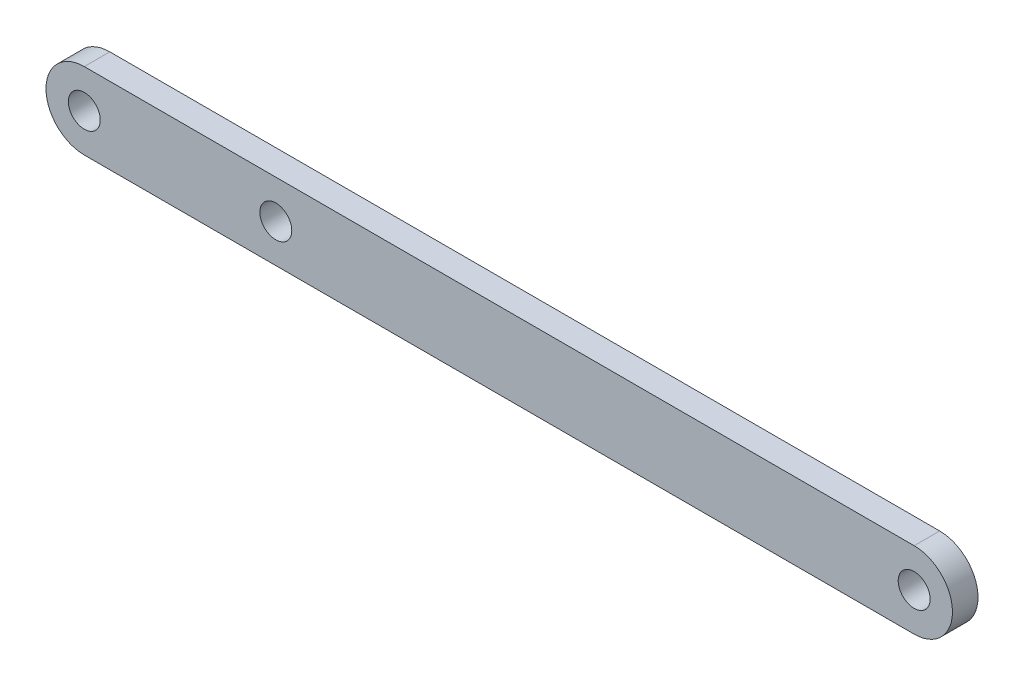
ISO-10303-21;
HEADER;
FILE_DESCRIPTION(('STEP AP214'),'2;1');
FILE_NAME('part.step','',(''),(''),'','','');
FILE_SCHEMA(('AUTOMOTIVE_DESIGN { 1 0 10303 214 1 1 1 1 }'));
ENDSEC;
DATA;
#1=APPLICATION_CONTEXT('core data for automotive mechanical design processes');
#2=APPLICATION_PROTOCOL_DEFINITION('international standard','automotive_design',2000,#1);
#3=PRODUCT_CONTEXT('',#1,'mechanical');
#4=PRODUCT('Part','Part','',(#3));
#5=PRODUCT_RELATED_PRODUCT_CATEGORY('part','',(#4));
#6=PRODUCT_DEFINITION_FORMATION('','',#4);
#7=PRODUCT_DEFINITION_CONTEXT('part definition',#1,'design');
#8=PRODUCT_DEFINITION('design','',#6,#7);
#9=PRODUCT_DEFINITION_SHAPE('','',#8);
#10=(LENGTH_UNIT() NAMED_UNIT(*) SI_UNIT(.MILLI.,.METRE.));
#11=(NAMED_UNIT(*) PLANE_ANGLE_UNIT() SI_UNIT($,.RADIAN.));
#12=(NAMED_UNIT(*) SI_UNIT($,.STERADIAN.) SOLID_ANGLE_UNIT());
#13=UNCERTAINTY_MEASURE_WITH_UNIT(LENGTH_MEASURE(1.E-05),#10,'distance_accuracy_value','');
#14=(GEOMETRIC_REPRESENTATION_CONTEXT(3) GLOBAL_UNCERTAINTY_ASSIGNED_CONTEXT((#13)) GLOBAL_UNIT_ASSIGNED_CONTEXT((#10,
#11,#12)) REPRESENTATION_CONTEXT('',''));
#15=CARTESIAN_POINT('',(0.,0.,0.));
#16=DIRECTION('',(0.,0.,1.));
#17=DIRECTION('',(1.,0.,0.));
#18=AXIS2_PLACEMENT_3D('',#15,#16,#17);
#19=CARTESIAN_POINT('',(0.,5.99999999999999,4.));
#20=DIRECTION('',(0.,1.,0.));
#21=DIRECTION('',(-1.,0.,0.));
#22=AXIS2_PLACEMENT_3D('',#19,#20,#21);
#23=PLANE('',#22);
#24=DIRECTION('',(1.,0.,0.));
#25=VECTOR('',#24,1.);
#26=CARTESIAN_POINT('',(0.,5.99999999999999,0.));
#27=LINE('',#26,#25);
#28=CARTESIAN_POINT('',(-80.,6.,0.));
#29=VERTEX_POINT('',#28);
#30=CARTESIAN_POINT('',(50.,6.00000000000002,0.));
#31=VERTEX_POINT('',#30);
#32=EDGE_CURVE('E108',#29,#31,#27,.T.);
#33=ORIENTED_EDGE('',*,*,#32,.F.);
#34=DIRECTION('',(0.,0.,-1.));
#35=VECTOR('',#34,1.);
#36=CARTESIAN_POINT('',(-80.,6.,4.));
#37=LINE('',#36,#35);
#38=CARTESIAN_POINT('',(-80.,6.,4.));
#39=VERTEX_POINT('',#38);
#40=EDGE_CURVE('E11',#39,#29,#37,.T.);
#41=ORIENTED_EDGE('',*,*,#40,.F.);
#42=DIRECTION('',(1.,0.,0.));
#43=VECTOR('',#42,1.);
#44=CARTESIAN_POINT('',(0.,5.99999999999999,4.));
#45=LINE('',#44,#43);
#46=CARTESIAN_POINT('',(50.,6.00000000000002,4.));
#47=VERTEX_POINT('',#46);
#48=EDGE_CURVE('E94',#39,#47,#45,.T.);
#49=ORIENTED_EDGE('',*,*,#48,.T.);
#50=DIRECTION('',(0.,0.,-1.));
#51=VECTOR('',#50,1.);
#52=CARTESIAN_POINT('',(50.,6.00000000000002,4.));
#53=LINE('',#52,#51);
#54=EDGE_CURVE('E76',#47,#31,#53,.T.);
#55=ORIENTED_EDGE('',*,*,#54,.T.);
#56=EDGE_LOOP('',(#33,#41,#49,#55));
#57=FACE_BOUND('',#56,.T.);
#58=ADVANCED_FACE('F37',(#57),#23,.T.);
#59=CARTESIAN_POINT('',(-80.,0.,4.));
#60=DIRECTION('',(0.,0.,-1.));
#61=DIRECTION('',(-1.,0.,0.));
#62=AXIS2_PLACEMENT_3D('',#59,#60,#61);
#63=CYLINDRICAL_SURFACE('',#62,6.);
#64=CARTESIAN_POINT('',(-80.,0.,0.));
#65=DIRECTION('',(0.,0.,1.));
#66=DIRECTION('',(1.,0.,0.));
#67=AXIS2_PLACEMENT_3D('',#64,#65,#66);
#68=CIRCLE('',#67,6.);
#69=CARTESIAN_POINT('',(-80.,-6.,0.));
#70=VERTEX_POINT('',#69);
#71=EDGE_CURVE('E99',#29,#70,#68,.T.);
#72=ORIENTED_EDGE('',*,*,#71,.T.);
#73=DIRECTION('',(0.,0.,-1.));
#74=VECTOR('',#73,1.);
#75=CARTESIAN_POINT('',(-80.,-6.,4.));
#76=LINE('',#75,#74);
#77=CARTESIAN_POINT('',(-80.,-6.,4.));
#78=VERTEX_POINT('',#77);
#79=EDGE_CURVE('E46',#78,#70,#76,.T.);
#80=ORIENTED_EDGE('',*,*,#79,.F.);
#81=CARTESIAN_POINT('',(-80.,0.,4.));
#82=DIRECTION('',(0.,0.,1.));
#83=DIRECTION('',(1.,0.,0.));
#84=AXIS2_PLACEMENT_3D('',#81,#82,#83);
#85=CIRCLE('',#84,6.);
#86=EDGE_CURVE('E91',#39,#78,#85,.T.);
#87=ORIENTED_EDGE('',*,*,#86,.F.);
#88=ORIENTED_EDGE('',*,*,#40,.T.);
#89=EDGE_LOOP('',(#72,#80,#87,#88));
#90=FACE_BOUND('',#89,.T.);
#91=ADVANCED_FACE('F97',(#90),#63,.T.);
#92=CARTESIAN_POINT('',(0.,-5.99999999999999,4.));
#93=DIRECTION('',(0.,1.,0.));
#94=DIRECTION('',(-1.,0.,0.));
#95=AXIS2_PLACEMENT_3D('',#92,#93,#94);
#96=PLANE('',#95);
#97=DIRECTION('',(1.,0.,0.));
#98=VECTOR('',#97,1.);
#99=CARTESIAN_POINT('',(0.,-5.99999999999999,0.));
#100=LINE('',#99,#98);
#101=CARTESIAN_POINT('',(50.,-5.99999999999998,0.));
#102=VERTEX_POINT('',#101);
#103=EDGE_CURVE('E105',#70,#102,#100,.T.);
#104=ORIENTED_EDGE('',*,*,#103,.T.);
#105=DIRECTION('',(0.,0.,-1.));
#106=VECTOR('',#105,1.);
#107=CARTESIAN_POINT('',(50.,-5.99999999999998,4.));
#108=LINE('',#107,#106);
#109=CARTESIAN_POINT('',(50.,-5.99999999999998,4.));
#110=VERTEX_POINT('',#109);
#111=EDGE_CURVE('E90',#110,#102,#108,.T.);
#112=ORIENTED_EDGE('',*,*,#111,.F.);
#113=DIRECTION('',(1.,0.,0.));
#114=VECTOR('',#113,1.);
#115=CARTESIAN_POINT('',(0.,-5.99999999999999,4.));
#116=LINE('',#115,#114);
#117=EDGE_CURVE('E84',#78,#110,#116,.T.);
#118=ORIENTED_EDGE('',*,*,#117,.F.);
#119=ORIENTED_EDGE('',*,*,#79,.T.);
#120=EDGE_LOOP('',(#104,#112,#118,#119));
#121=FACE_BOUND('',#120,.T.);
#122=ADVANCED_FACE('F87',(#121),#96,.F.);
#123=CARTESIAN_POINT('',(-80.,0.,4.));
#124=DIRECTION('',(0.,0.,-1.));
#125=DIRECTION('',(-1.,0.,0.));
#126=AXIS2_PLACEMENT_3D('',#123,#124,#125);
#127=CYLINDRICAL_SURFACE('',#126,2.5);
#128=CARTESIAN_POINT('',(-80.,0.,4.));
#129=DIRECTION('',(0.,0.,1.));
#130=DIRECTION('',(1.,0.,0.));
#131=AXIS2_PLACEMENT_3D('',#128,#129,#130);
#132=CIRCLE('',#131,2.5);
#133=CARTESIAN_POINT('',(-77.5,0.,4.));
#134=VERTEX_POINT('',#133);
#135=EDGE_CURVE('E121',#134,#134,#132,.T.);
#136=ORIENTED_EDGE('',*,*,#135,.T.);
#137=EDGE_LOOP('',(#136));
#138=FACE_BOUND('',#137,.T.);
#139=CARTESIAN_POINT('',(-80.,0.,0.));
#140=DIRECTION('',(0.,0.,1.));
#141=DIRECTION('',(1.,0.,0.));
#142=AXIS2_PLACEMENT_3D('',#139,#140,#141);
#143=CIRCLE('',#142,2.5);
#144=CARTESIAN_POINT('',(-77.5,0.,0.));
#145=VERTEX_POINT('',#144);
#146=EDGE_CURVE('E110',#145,#145,#143,.T.);
#147=ORIENTED_EDGE('',*,*,#146,.F.);
#148=EDGE_LOOP('',(#147));
#149=FACE_BOUND('',#148,.T.);
#150=ADVANCED_FACE('F141',(#138,#149),#127,.F.);
#151=CARTESIAN_POINT('',(50.,0.,4.));
#152=DIRECTION('',(0.,0.,-1.));
#153=DIRECTION('',(-1.,0.,0.));
#154=AXIS2_PLACEMENT_3D('',#151,#152,#153);
#155=CYLINDRICAL_SURFACE('',#154,2.5);
#156=CARTESIAN_POINT('',(50.,0.,4.));
#157=DIRECTION('',(0.,0.,1.));
#158=DIRECTION('',(1.,0.,0.));
#159=AXIS2_PLACEMENT_3D('',#156,#157,#158);
#160=CIRCLE('',#159,2.5);
#161=CARTESIAN_POINT('',(52.5,0.,4.));
#162=VERTEX_POINT('',#161);
#163=EDGE_CURVE('E124',#162,#162,#160,.T.);
#164=ORIENTED_EDGE('',*,*,#163,.T.);
#165=EDGE_LOOP('',(#164));
#166=FACE_BOUND('',#165,.T.);
#167=CARTESIAN_POINT('',(50.,0.,0.));
#168=DIRECTION('',(0.,0.,1.));
#169=DIRECTION('',(1.,0.,0.));
#170=AXIS2_PLACEMENT_3D('',#167,#168,#169);
#171=CIRCLE('',#170,2.5);
#172=CARTESIAN_POINT('',(52.5,0.,0.));
#173=VERTEX_POINT('',#172);
#174=EDGE_CURVE('E113',#173,#173,#171,.T.);
#175=ORIENTED_EDGE('',*,*,#174,.F.);
#176=EDGE_LOOP('',(#175));
#177=FACE_BOUND('',#176,.T.);
#178=ADVANCED_FACE('F144',(#166,#177),#155,.F.);
#179=CARTESIAN_POINT('',(-50.,0.,4.));
#180=DIRECTION('',(0.,0.,-1.));
#181=DIRECTION('',(-1.,0.,0.));
#182=AXIS2_PLACEMENT_3D('',#179,#180,#181);
#183=CYLINDRICAL_SURFACE('',#182,2.5);
#184=CARTESIAN_POINT('',(-50.,0.,4.));
#185=DIRECTION('',(0.,0.,1.));
#186=DIRECTION('',(1.,0.,0.));
#187=AXIS2_PLACEMENT_3D('',#184,#185,#186);
#188=CIRCLE('',#187,2.5);
#189=CARTESIAN_POINT('',(-47.5,0.,4.));
#190=VERTEX_POINT('',#189);
#191=EDGE_CURVE('E104',#190,#190,#188,.T.);
#192=ORIENTED_EDGE('',*,*,#191,.T.);
#193=EDGE_LOOP('',(#192));
#194=FACE_BOUND('',#193,.T.);
#195=CARTESIAN_POINT('',(-50.,0.,0.));
#196=DIRECTION('',(0.,0.,1.));
#197=DIRECTION('',(1.,0.,0.));
#198=AXIS2_PLACEMENT_3D('',#195,#196,#197);
#199=CIRCLE('',#198,2.5);
#200=CARTESIAN_POINT('',(-47.5,0.,0.));
#201=VERTEX_POINT('',#200);
#202=EDGE_CURVE('E116',#201,#201,#199,.T.);
#203=ORIENTED_EDGE('',*,*,#202,.F.);
#204=EDGE_LOOP('',(#203));
#205=FACE_BOUND('',#204,.T.);
#206=ADVANCED_FACE('F39',(#194,#205),#183,.F.);
#207=CARTESIAN_POINT('',(50.,0.,4.));
#208=DIRECTION('',(0.,0.,-1.));
#209=DIRECTION('',(-1.,0.,0.));
#210=AXIS2_PLACEMENT_3D('',#207,#208,#209);
#211=CYLINDRICAL_SURFACE('',#210,6.);
#212=CARTESIAN_POINT('',(50.,0.,0.));
#213=DIRECTION('',(0.,0.,1.));
#214=DIRECTION('',(1.,0.,0.));
#215=AXIS2_PLACEMENT_3D('',#212,#213,#214);
#216=CIRCLE('',#215,6.);
#217=EDGE_CURVE('E69',#102,#31,#216,.T.);
#218=ORIENTED_EDGE('',*,*,#217,.T.);
#219=ORIENTED_EDGE('',*,*,#54,.F.);
#220=CARTESIAN_POINT('',(50.,0.,4.));
#221=DIRECTION('',(0.,0.,1.));
#222=DIRECTION('',(1.,0.,0.));
#223=AXIS2_PLACEMENT_3D('',#220,#221,#222);
#224=CIRCLE('',#223,6.);
#225=EDGE_CURVE('E54',#110,#47,#224,.T.);
#226=ORIENTED_EDGE('',*,*,#225,.F.);
#227=ORIENTED_EDGE('',*,*,#111,.T.);
#228=EDGE_LOOP('',(#218,#219,#226,#227));
#229=FACE_BOUND('',#228,.T.);
#230=ADVANCED_FACE('F135',(#229),#211,.T.);
#231=CARTESIAN_POINT('',(0.,0.,4.));
#232=DIRECTION('',(0.,0.,1.));
#233=DIRECTION('',(1.,0.,0.));
#234=AXIS2_PLACEMENT_3D('',#231,#232,#233);
#235=PLANE('',#234);
#236=ORIENTED_EDGE('',*,*,#191,.F.);
#237=EDGE_LOOP('',(#236));
#238=FACE_BOUND('',#237,.T.);
#239=ORIENTED_EDGE('',*,*,#163,.F.);
#240=EDGE_LOOP('',(#239));
#241=FACE_BOUND('',#240,.T.);
#242=ORIENTED_EDGE('',*,*,#135,.F.);
#243=EDGE_LOOP('',(#242));
#244=FACE_BOUND('',#243,.T.);
#245=ORIENTED_EDGE('',*,*,#48,.F.);
#246=ORIENTED_EDGE('',*,*,#86,.T.);
#247=ORIENTED_EDGE('',*,*,#117,.T.);
#248=ORIENTED_EDGE('',*,*,#225,.T.);
#249=EDGE_LOOP('',(#245,#246,#247,#248));
#250=FACE_BOUND('',#249,.T.);
#251=ADVANCED_FACE('F93',(#238,#241,#244,#250),#235,.T.);
#252=CARTESIAN_POINT('',(0.,0.,0.));
#253=DIRECTION('',(0.,0.,1.));
#254=DIRECTION('',(1.,0.,0.));
#255=AXIS2_PLACEMENT_3D('',#252,#253,#254);
#256=PLANE('',#255);
#257=ORIENTED_EDGE('',*,*,#202,.T.);
#258=EDGE_LOOP('',(#257));
#259=FACE_BOUND('',#258,.T.);
#260=ORIENTED_EDGE('',*,*,#174,.T.);
#261=EDGE_LOOP('',(#260));
#262=FACE_BOUND('',#261,.T.);
#263=ORIENTED_EDGE('',*,*,#146,.T.);
#264=EDGE_LOOP('',(#263));
#265=FACE_BOUND('',#264,.T.);
#266=ORIENTED_EDGE('',*,*,#32,.T.);
#267=ORIENTED_EDGE('',*,*,#217,.F.);
#268=ORIENTED_EDGE('',*,*,#103,.F.);
#269=ORIENTED_EDGE('',*,*,#71,.F.);
#270=EDGE_LOOP('',(#266,#267,#268,#269));
#271=FACE_BOUND('',#270,.T.);
#272=ADVANCED_FACE('F134',(#259,#262,#265,#271),#256,.F.);
#273=CLOSED_SHELL('',(#58,#91,#122,#150,#178,#206,#230,#251,#272));
#274=MANIFOLD_SOLID_BREP('B2',#273);
#275=ADVANCED_BREP_SHAPE_REPRESENTATION('',(#18,#274),#14);
#276=SHAPE_DEFINITION_REPRESENTATION(#9,#275);
ENDSEC;
END-ISO-10303-21;
